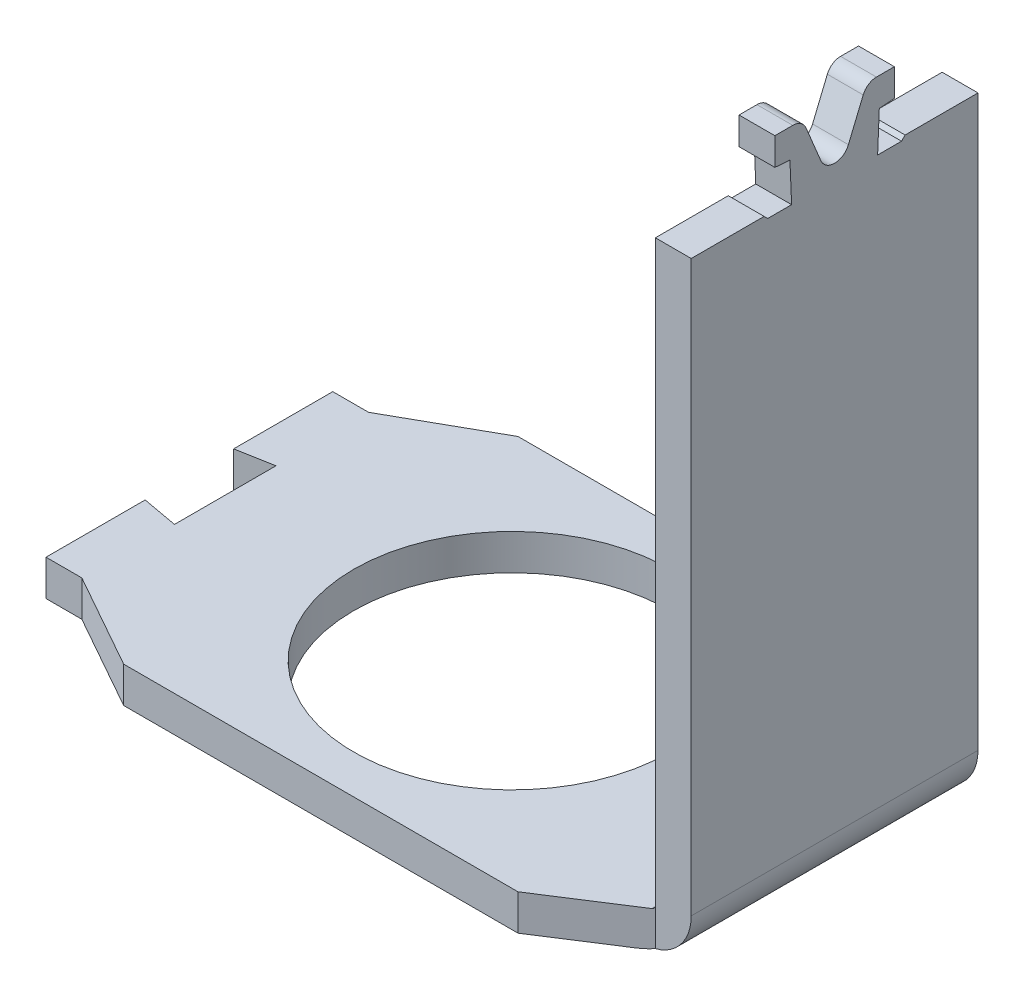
from build123d import *

# Parameters (mm, degrees)
EXTRUSION1_DEPTH             = 16.5
ENL_V_MAT_EXTRU_1_DEPTH      = 79.164266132
ENL_V_MAT_EXTRU_1_DEPTH_BACK = 33
ESQUISSE2_OUTSIDE_W          = 73.04
ESQUISSE2_OUTSIDE_H          = 52.04
ESQUISSE2_OUTSIDE_R          = 13.25
ENL_V_MAT_EXTRU_2_DEPTH      = 79.28123977


with BuildPart() as part:
    # Esquisse1 → Extrusion1 (new, symmetric)
    with BuildSketch(Plane.XY):
        with BuildLine():
            Line((-4, 0), (-54, 0))
            Line((-54, 0), (-54, 3))
            Line((-54, 3), (-3.2, 3))
            ThreePointArc((-3.2, 3), (-3.058578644, 3.058578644), (-3, 3.2))
            Line((-3, 3.2), (-3, 57.05))
            Line((-3, 57.05), (0, 57.05))
            Line((0, 57.05), (0, 4))
            ThreePointArc((0, 4), (-1.171572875, 1.171572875), (-4, 0))
        make_face()
    extrude(amount=EXTRUSION1_DEPTH, both=True)

    # Esquisse2 outside → Enl_v. mat.-Extru.1 (cut, two sides: drawn at the far end of the back side and taken through both)
    # profile 1 of 2: a face of its own
    with BuildSketch(Plane(origin=(0, 3, 0), x_dir=(-1, 0, 0), z_dir=(0, 1, 0)).offset(-ENL_V_MAT_EXTRU_1_DEPTH_BACK)):
        with Locations((27, 0)):
            Rectangle(ESQUISSE2_OUTSIDE_W, ESQUISSE2_OUTSIDE_H)
        Polygon((3, -12), (10, -16.5), (43, -16.5), (51, -12), (57, -12), (57, -3.7), (54, -3.7), (51, -4.25), (51, 4.25), (54, 3.7), (57, 3.7), (57, 12), (51, 12), (43, 16.5), (10, 16.5), (3, 12), (0, 12), (0, -12), align=None, mode=Mode.SUBTRACT)
    # profile 2 of 2: a face of its own
    with BuildSketch(Plane(origin=(0, 3, 0), x_dir=(-1, 0, 0), z_dir=(0, 1, 0)).offset(-ENL_V_MAT_EXTRU_1_DEPTH_BACK)):
        with Locations(Location((27, 0, 0), (0, 0, 180))):
            Circle(ESQUISSE2_OUTSIDE_R)
    extrude(amount=ENL_V_MAT_EXTRU_1_DEPTH + ENL_V_MAT_EXTRU_1_DEPTH_BACK, mode=Mode.SUBTRACT)

    # Esquisse3 → Enl_v. mat.-Extru.2 (cut, through all)
    with BuildSketch(Plane.ZY.offset(3)):
        Polygon((3.6, 51.35), (3.73831098, 54.65), (5, 54.75), (5, 57.05), (13.2, 57.05), (13.2, 51.65), (5.9, 51.65), (5.6, 51.35), align=None)
        with BuildLine():
            Line((-3.5, 57.05), (-3.5, 58.55))
            Line((-3.5, 58.55), (3.5, 58.55))
            Line((3.5, 58.55), (3.5, 57.05))
            ThreePointArc((3.5, 57.05), (2.83317335, 56.847668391), (2.391213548, 56.308903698))
            Line((2.391213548, 56.308903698), (1.154985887, 53.321975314))
            ThreePointArc((1.154985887, 53.321975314), (0, 52.55), (-1.154985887, 53.321975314))
            Line((-1.154985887, 53.321975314), (-2.391213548, 56.308903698))
            ThreePointArc((-2.391213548, 56.308903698), (-2.83317335, 56.847668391), (-3.5, 57.05))
        make_face()
        Polygon((-5, 54.75), (-5, 57.05), (-13.2, 57.05), (-13.2, 51.65), (-5.9, 51.65), (-5.6, 51.35), (-3.6, 51.35), (-3.73831098, 54.65), align=None)
    extrude(amount=-ENL_V_MAT_EXTRU_2_DEPTH, mode=Mode.SUBTRACT)


solid = part.part
